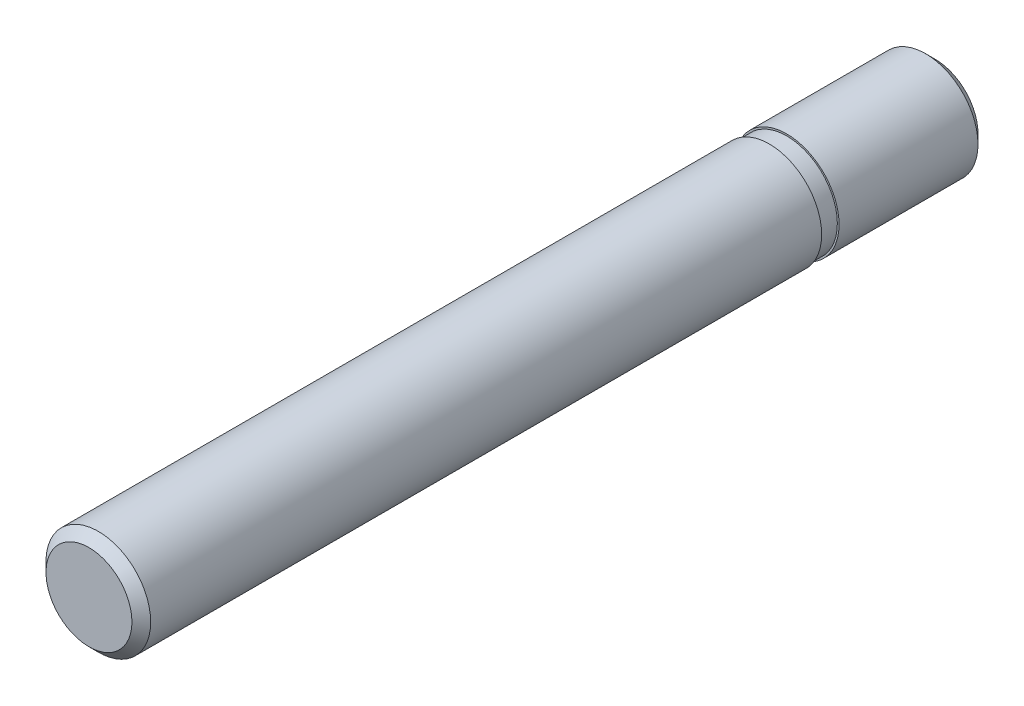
ISO-10303-21;
HEADER;
FILE_DESCRIPTION(('STEP AP214'),'2;1');
FILE_NAME('part.step','',(''),(''),'','','');
FILE_SCHEMA(('AUTOMOTIVE_DESIGN { 1 0 10303 214 1 1 1 1 }'));
ENDSEC;
DATA;
#1=APPLICATION_CONTEXT('core data for automotive mechanical design processes');
#2=APPLICATION_PROTOCOL_DEFINITION('international standard','automotive_design',2000,#1);
#3=PRODUCT_CONTEXT('',#1,'mechanical');
#4=PRODUCT('Part','Part','',(#3));
#5=PRODUCT_RELATED_PRODUCT_CATEGORY('part','',(#4));
#6=PRODUCT_DEFINITION_FORMATION('','',#4);
#7=PRODUCT_DEFINITION_CONTEXT('part definition',#1,'design');
#8=PRODUCT_DEFINITION('design','',#6,#7);
#9=PRODUCT_DEFINITION_SHAPE('','',#8);
#10=(LENGTH_UNIT() NAMED_UNIT(*) SI_UNIT(.MILLI.,.METRE.));
#11=(NAMED_UNIT(*) PLANE_ANGLE_UNIT() SI_UNIT($,.RADIAN.));
#12=(NAMED_UNIT(*) SI_UNIT($,.STERADIAN.) SOLID_ANGLE_UNIT());
#13=UNCERTAINTY_MEASURE_WITH_UNIT(LENGTH_MEASURE(1.E-05),#10,'distance_accuracy_value','');
#14=(GEOMETRIC_REPRESENTATION_CONTEXT(3) GLOBAL_UNCERTAINTY_ASSIGNED_CONTEXT((#13)) GLOBAL_UNIT_ASSIGNED_CONTEXT((#10,
#11,#12)) REPRESENTATION_CONTEXT('',''));
#15=CARTESIAN_POINT('',(0.,0.,0.));
#16=DIRECTION('',(0.,0.,1.));
#17=DIRECTION('',(1.,0.,0.));
#18=AXIS2_PLACEMENT_3D('',#15,#16,#17);
#19=CARTESIAN_POINT('',(0.,2.46325,-17.));
#20=DIRECTION('',(0.,0.,-1.));
#21=DIRECTION('',(-1.,0.,0.));
#22=AXIS2_PLACEMENT_3D('',#19,#20,#21);
#23=PLANE('',#22);
#24=CARTESIAN_POINT('',(0.,0.,-17.0000000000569));
#25=DIRECTION('',(0.,0.,1.));
#26=DIRECTION('',(1.,0.,0.));
#27=AXIS2_PLACEMENT_3D('',#24,#25,#26);
#28=CIRCLE('',#27,4.92649999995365);
#29=CARTESIAN_POINT('',(4.92649999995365,0.,-17.0000000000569));
#30=VERTEX_POINT('',#29);
#31=EDGE_CURVE('E19',#30,#30,#28,.T.);
#32=ORIENTED_EDGE('',*,*,#31,.F.);
#33=EDGE_LOOP('',(#32));
#34=FACE_BOUND('',#33,.T.);
#35=ADVANCED_FACE('F12',(#34),#23,.T.);
#36=CARTESIAN_POINT('',(0.,0.,-15.9264999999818));
#37=DIRECTION('',(0.,0.,1.));
#38=DIRECTION('',(1.,0.,0.));
#39=AXIS2_PLACEMENT_3D('',#36,#37,#38);
#40=CONICAL_SURFACE('',#39,6.00000000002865,0.785398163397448);
#41=CARTESIAN_POINT('',(0.,0.,-15.9265));
#42=DIRECTION('',(0.,0.,1.));
#43=DIRECTION('',(1.,0.,0.));
#44=AXIS2_PLACEMENT_3D('',#41,#42,#43);
#45=CIRCLE('',#44,6.);
#46=CARTESIAN_POINT('',(6.,0.,-15.9265));
#47=VERTEX_POINT('',#46);
#48=EDGE_CURVE('E23',#47,#47,#45,.T.);
#49=ORIENTED_EDGE('',*,*,#48,.F.);
#50=EDGE_LOOP('',(#49));
#51=FACE_BOUND('',#50,.T.);
#52=ORIENTED_EDGE('',*,*,#31,.T.);
#53=EDGE_LOOP('',(#52));
#54=FACE_BOUND('',#53,.T.);
#55=ADVANCED_FACE('F66',(#51,#54),#40,.T.);
#56=CARTESIAN_POINT('',(0.,0.,7.5));
#57=DIRECTION('',(0.,0.,1.));
#58=DIRECTION('',(1.,0.,0.));
#59=AXIS2_PLACEMENT_3D('',#56,#57,#58);
#60=CYLINDRICAL_SURFACE('',#59,6.);
#61=CARTESIAN_POINT('',(0.,0.,0.));
#62=DIRECTION('',(0.,0.,1.));
#63=DIRECTION('',(1.,0.,0.));
#64=AXIS2_PLACEMENT_3D('',#61,#62,#63);
#65=CIRCLE('',#64,6.);
#66=CARTESIAN_POINT('',(6.,0.,0.));
#67=VERTEX_POINT('',#66);
#68=EDGE_CURVE('E28',#67,#67,#65,.T.);
#69=ORIENTED_EDGE('',*,*,#68,.F.);
#70=EDGE_LOOP('',(#69));
#71=FACE_BOUND('',#70,.T.);
#72=ORIENTED_EDGE('',*,*,#48,.T.);
#73=EDGE_LOOP('',(#72));
#74=FACE_BOUND('',#73,.T.);
#75=ADVANCED_FACE('F72',(#71,#74),#60,.T.);
#76=CARTESIAN_POINT('',(0.,0.,0.));
#77=DIRECTION('',(0.,0.,1.));
#78=DIRECTION('',(1.,0.,0.));
#79=AXIS2_PLACEMENT_3D('',#76,#77,#78);
#80=PLANE('',#79);
#81=CARTESIAN_POINT('',(0.,0.,0.));
#82=DIRECTION('',(0.,0.,1.));
#83=DIRECTION('',(1.,0.,0.));
#84=AXIS2_PLACEMENT_3D('',#81,#82,#83);
#85=CIRCLE('',#84,5.8);
#86=CARTESIAN_POINT('',(5.8,0.,0.));
#87=VERTEX_POINT('',#86);
#88=EDGE_CURVE('E8',#87,#87,#85,.T.);
#89=ORIENTED_EDGE('',*,*,#88,.F.);
#90=EDGE_LOOP('',(#89));
#91=FACE_BOUND('',#90,.T.);
#92=ORIENTED_EDGE('',*,*,#68,.T.);
#93=EDGE_LOOP('',(#92));
#94=FACE_BOUND('',#93,.T.);
#95=ADVANCED_FACE('F77',(#91,#94),#80,.T.);
#96=CARTESIAN_POINT('',(0.,0.,-3.49591858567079));
#97=DIRECTION('',(0.,0.,-1.));
#98=DIRECTION('',(-1.,0.,0.));
#99=AXIS2_PLACEMENT_3D('',#96,#97,#98);
#100=CYLINDRICAL_SURFACE('',#99,5.8);
#101=CARTESIAN_POINT('',(0.,0.,2.));
#102=DIRECTION('',(0.,0.,-1.));
#103=DIRECTION('',(-1.,0.,0.));
#104=AXIS2_PLACEMENT_3D('',#101,#102,#103);
#105=CIRCLE('',#104,5.8);
#106=CARTESIAN_POINT('',(-5.8,0.,2.));
#107=VERTEX_POINT('',#106);
#108=EDGE_CURVE('E44',#107,#107,#105,.T.);
#109=ORIENTED_EDGE('',*,*,#108,.T.);
#110=EDGE_LOOP('',(#109));
#111=FACE_BOUND('',#110,.T.);
#112=ORIENTED_EDGE('',*,*,#88,.T.);
#113=EDGE_LOOP('',(#112));
#114=FACE_BOUND('',#113,.T.);
#115=ADVANCED_FACE('F51',(#111,#114),#100,.T.);
#116=CARTESIAN_POINT('',(0.,0.,80.));
#117=DIRECTION('',(0.,0.,1.));
#118=DIRECTION('',(1.,0.,0.));
#119=AXIS2_PLACEMENT_3D('',#116,#117,#118);
#120=PLANE('',#119);
#121=CARTESIAN_POINT('',(0.,0.,80.));
#122=DIRECTION('',(0.,0.,1.));
#123=DIRECTION('',(1.,0.,0.));
#124=AXIS2_PLACEMENT_3D('',#121,#122,#123);
#125=CIRCLE('',#124,4.9265);
#126=CARTESIAN_POINT('',(4.9265,0.,80.));
#127=VERTEX_POINT('',#126);
#128=EDGE_CURVE('E40',#127,#127,#125,.T.);
#129=ORIENTED_EDGE('',*,*,#128,.T.);
#130=EDGE_LOOP('',(#129));
#131=FACE_BOUND('',#130,.T.);
#132=ADVANCED_FACE('F85',(#131),#120,.T.);
#133=CARTESIAN_POINT('',(0.,0.,80.));
#134=DIRECTION('',(0.,0.,-1.));
#135=DIRECTION('',(-1.,0.,0.));
#136=AXIS2_PLACEMENT_3D('',#133,#134,#135);
#137=CONICAL_SURFACE('',#136,4.9265,0.785398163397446);
#138=CARTESIAN_POINT('',(0.,0.,78.9265));
#139=DIRECTION('',(0.,0.,1.));
#140=DIRECTION('',(1.,0.,0.));
#141=AXIS2_PLACEMENT_3D('',#138,#139,#140);
#142=CIRCLE('',#141,6.);
#143=CARTESIAN_POINT('',(6.,0.,78.9265));
#144=VERTEX_POINT('',#143);
#145=EDGE_CURVE('E31',#144,#144,#142,.F.);
#146=ORIENTED_EDGE('',*,*,#145,.F.);
#147=EDGE_LOOP('',(#146));
#148=FACE_BOUND('',#147,.T.);
#149=ORIENTED_EDGE('',*,*,#128,.F.);
#150=EDGE_LOOP('',(#149));
#151=FACE_BOUND('',#150,.T.);
#152=ADVANCED_FACE('F62',(#148,#151),#137,.T.);
#153=CARTESIAN_POINT('',(0.,0.,7.5));
#154=DIRECTION('',(0.,0.,1.));
#155=DIRECTION('',(1.,0.,0.));
#156=AXIS2_PLACEMENT_3D('',#153,#154,#155);
#157=CYLINDRICAL_SURFACE('',#156,6.);
#158=CARTESIAN_POINT('',(0.,0.,2.));
#159=DIRECTION('',(0.,0.,1.));
#160=DIRECTION('',(1.,0.,0.));
#161=AXIS2_PLACEMENT_3D('',#158,#159,#160);
#162=CIRCLE('',#161,6.);
#163=CARTESIAN_POINT('',(6.,0.,2.));
#164=VERTEX_POINT('',#163);
#165=EDGE_CURVE('E35',#164,#164,#162,.T.);
#166=ORIENTED_EDGE('',*,*,#165,.T.);
#167=EDGE_LOOP('',(#166));
#168=FACE_BOUND('',#167,.T.);
#169=ORIENTED_EDGE('',*,*,#145,.T.);
#170=EDGE_LOOP('',(#169));
#171=FACE_BOUND('',#170,.T.);
#172=ADVANCED_FACE('F14',(#168,#171),#157,.T.);
#173=CARTESIAN_POINT('',(0.,0.,2.));
#174=DIRECTION('',(0.,0.,1.));
#175=DIRECTION('',(1.,0.,0.));
#176=AXIS2_PLACEMENT_3D('',#173,#174,#175);
#177=PLANE('',#176);
#178=ORIENTED_EDGE('',*,*,#108,.F.);
#179=EDGE_LOOP('',(#178));
#180=FACE_BOUND('',#179,.T.);
#181=ORIENTED_EDGE('',*,*,#165,.F.);
#182=EDGE_LOOP('',(#181));
#183=FACE_BOUND('',#182,.T.);
#184=ADVANCED_FACE('F53',(#180,#183),#177,.F.);
#185=CLOSED_SHELL('',(#35,#55,#75,#95,#115,#132,#152,#172,#184));
#186=MANIFOLD_SOLID_BREP('B1',#185);
#187=ADVANCED_BREP_SHAPE_REPRESENTATION('',(#18,#186),#14);
#188=SHAPE_DEFINITION_REPRESENTATION(#9,#187);
ENDSEC;
END-ISO-10303-21;
